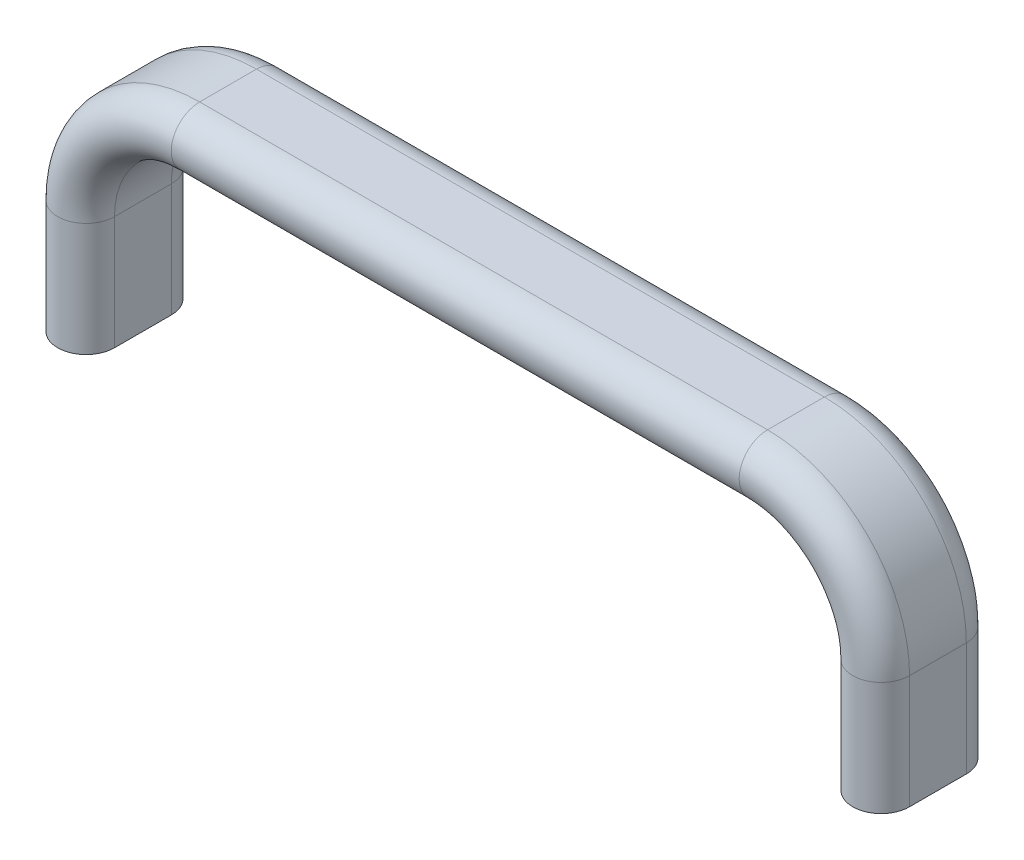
from build123d import *

# Parameters (mm, degrees)
SKETCH3_R      = 2.1
EXTRUDE1_DEPTH = 12.5
SKETCH4_R      = 2.5
EXTRUDE2_DEPTH = 10


with BuildPart() as part:
    # Sweep1: sweep along a path in Sketch1
    with BuildLine(Plane.XY) as sweep1_path:
        Line((-70, 0), (-70, 20))
        ThreePointArc((-70, 20), (-64.142135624, 34.142135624), (-50, 40))
        Line((-50, 40), (50, 40))
        ThreePointArc((50, 40), (64.142135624, 34.142135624), (70, 20))
        Line((70, 20), (70, 0))
    # Sketch2 → Sweep1 (sweep)
    with BuildSketch(Plane(origin=(0, 0, 0), x_dir=(1, 0, 0), z_dir=(0, 1, 0))):
        with BuildLine():
            Line((-75, -5), (-75, 5))
            ThreePointArc((-75, 5), (-70, 10), (-65, 5))
            Line((-65, 5), (-65, -5))
            ThreePointArc((-65, -5), (-70, -10), (-75, -5))
        make_face()
    sweep(path=sweep1_path.line)

    # Sketch3 → Extrude1 (cut)
    with BuildSketch(Plane.XZ):
        with Locations(Location((-70, 0, 0), (0, 0, 270))):
            Circle(SKETCH3_R)
    extrude1 = extrude(amount=-EXTRUDE1_DEPTH, mode=Mode.SUBTRACT)

    # Sketch4 → Extrude2 (cut)
    with BuildSketch(Plane.XZ):
        with Locations(Location((-70, 0, 0), (0, 0, 270))):
            Circle(SKETCH4_R)
    extrude2 = extrude(amount=-EXTRUDE2_DEPTH, mode=Mode.SUBTRACT)

    # Sketch5 → Cut-Revolve1 (revolve, cut)
    with BuildSketch(Plane.XY, mode=Mode.PRIVATE) as cut_revolve1_sk:
        Polygon((-70, 12.5), (-72.1, 12.5), (-70, 13.712435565), align=None)
    cut_revolve1 = revolve(cut_revolve1_sk.sketch.rotate(Axis((-70, 13.712435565, 0), (0, -1, 0)), 90), axis=Axis((-70, 13.712435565, 0), (0, -1, 0)), mode=Mode.SUBTRACT)

    # Mirror1: Extrude1, Extrude2, Cut-Revolve1 across plane
    add(extrude1.mirror(Plane(origin=(0, 0, 0), x_dir=(0, 0, 1), z_dir=(1, 0, 0))), mode=Mode.SUBTRACT)
    add(extrude2.mirror(Plane(origin=(0, 0, 0), x_dir=(0, 0, 1), z_dir=(1, 0, 0))), mode=Mode.SUBTRACT)
    add(cut_revolve1.mirror(Plane(origin=(0, 0, 0), x_dir=(0, 0, 1), z_dir=(1, 0, 0))), mode=Mode.SUBTRACT)


solid = part.part
